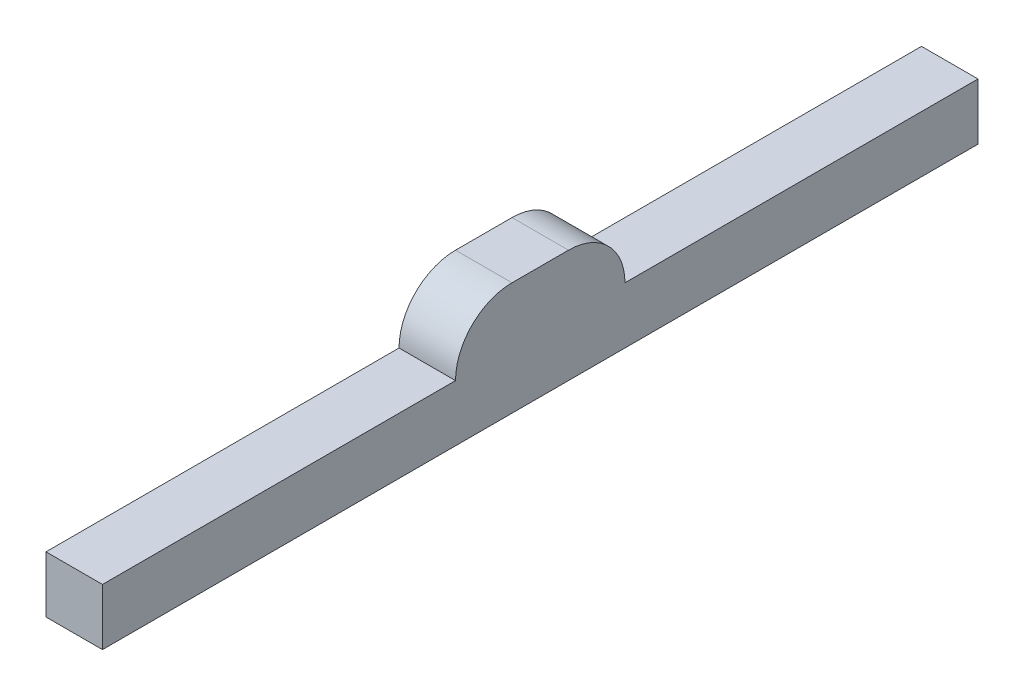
ISO-10303-21;
HEADER;
FILE_DESCRIPTION(('STEP AP214'),'2;1');
FILE_NAME('part.step','',(''),(''),'','','');
FILE_SCHEMA(('AUTOMOTIVE_DESIGN { 1 0 10303 214 1 1 1 1 }'));
ENDSEC;
DATA;
#1=APPLICATION_CONTEXT('core data for automotive mechanical design processes');
#2=APPLICATION_PROTOCOL_DEFINITION('international standard','automotive_design',2000,#1);
#3=PRODUCT_CONTEXT('',#1,'mechanical');
#4=PRODUCT('Part','Part','',(#3));
#5=PRODUCT_RELATED_PRODUCT_CATEGORY('part','',(#4));
#6=PRODUCT_DEFINITION_FORMATION('','',#4);
#7=PRODUCT_DEFINITION_CONTEXT('part definition',#1,'design');
#8=PRODUCT_DEFINITION('design','',#6,#7);
#9=PRODUCT_DEFINITION_SHAPE('','',#8);
#10=(LENGTH_UNIT() NAMED_UNIT(*) SI_UNIT(.MILLI.,.METRE.));
#11=(NAMED_UNIT(*) PLANE_ANGLE_UNIT() SI_UNIT($,.RADIAN.));
#12=(NAMED_UNIT(*) SI_UNIT($,.STERADIAN.) SOLID_ANGLE_UNIT());
#13=UNCERTAINTY_MEASURE_WITH_UNIT(LENGTH_MEASURE(1.E-05),#10,'distance_accuracy_value','');
#14=(GEOMETRIC_REPRESENTATION_CONTEXT(3) GLOBAL_UNCERTAINTY_ASSIGNED_CONTEXT((#13)) GLOBAL_UNIT_ASSIGNED_CONTEXT((#10,
#11,#12)) REPRESENTATION_CONTEXT('',''));
#15=CARTESIAN_POINT('',(0.,0.,0.));
#16=DIRECTION('',(0.,0.,1.));
#17=DIRECTION('',(1.,0.,0.));
#18=AXIS2_PLACEMENT_3D('',#15,#16,#17);
#19=CARTESIAN_POINT('',(0.,2.,31.));
#20=DIRECTION('',(0.,-1.,0.));
#21=DIRECTION('',(0.,0.,-1.));
#22=AXIS2_PLACEMENT_3D('',#19,#20,#21);
#23=PLANE('',#22);
#24=DIRECTION('',(1.,0.,0.));
#25=VECTOR('',#24,1.);
#26=CARTESIAN_POINT('',(0.,2.,18.5));
#27=LINE('',#26,#25);
#28=CARTESIAN_POINT('',(0.,2.,18.5));
#29=VERTEX_POINT('',#28);
#30=CARTESIAN_POINT('',(2.,2.,18.5));
#31=VERTEX_POINT('',#30);
#32=EDGE_CURVE('E132',#29,#31,#27,.T.);
#33=ORIENTED_EDGE('',*,*,#32,.F.);
#34=DIRECTION('',(0.,0.,-1.));
#35=VECTOR('',#34,1.);
#36=CARTESIAN_POINT('',(0.,2.,31.));
#37=LINE('',#36,#35);
#38=CARTESIAN_POINT('',(0.,2.,31.));
#39=VERTEX_POINT('',#38);
#40=EDGE_CURVE('E126',#39,#29,#37,.T.);
#41=ORIENTED_EDGE('',*,*,#40,.F.);
#42=DIRECTION('',(-1.,0.,0.));
#43=VECTOR('',#42,1.);
#44=CARTESIAN_POINT('',(0.,2.,31.));
#45=LINE('',#44,#43);
#46=CARTESIAN_POINT('',(2.,2.,31.));
#47=VERTEX_POINT('',#46);
#48=EDGE_CURVE('E127',#47,#39,#45,.T.);
#49=ORIENTED_EDGE('',*,*,#48,.F.);
#50=DIRECTION('',(0.,0.,-1.));
#51=VECTOR('',#50,1.);
#52=CARTESIAN_POINT('',(2.,2.,31.));
#53=LINE('',#52,#51);
#54=EDGE_CURVE('E167',#47,#31,#53,.T.);
#55=ORIENTED_EDGE('',*,*,#54,.T.);
#56=EDGE_LOOP('',(#33,#41,#49,#55));
#57=FACE_BOUND('',#56,.T.);
#58=ADVANCED_FACE('F45',(#57),#23,.F.);
#59=DIRECTION('',(-1.,0.,0.));
#60=VECTOR('',#59,1.);
#61=CARTESIAN_POINT('',(0.,2.,12.5));
#62=LINE('',#61,#60);
#63=CARTESIAN_POINT('',(2.,2.,12.5));
#64=VERTEX_POINT('',#63);
#65=CARTESIAN_POINT('',(0.,2.,12.5));
#66=VERTEX_POINT('',#65);
#67=EDGE_CURVE('E120',#64,#66,#62,.T.);
#68=ORIENTED_EDGE('',*,*,#67,.F.);
#69=CARTESIAN_POINT('',(2.,2.,0.));
#70=VERTEX_POINT('',#69);
#71=EDGE_CURVE('E166',#64,#70,#53,.T.);
#72=ORIENTED_EDGE('',*,*,#71,.T.);
#73=DIRECTION('',(-1.,0.,0.));
#74=VECTOR('',#73,1.);
#75=CARTESIAN_POINT('',(0.,2.,0.));
#76=LINE('',#75,#74);
#77=CARTESIAN_POINT('',(0.,2.,0.));
#78=VERTEX_POINT('',#77);
#79=EDGE_CURVE('E123',#70,#78,#76,.T.);
#80=ORIENTED_EDGE('',*,*,#79,.T.);
#81=EDGE_CURVE('E113',#66,#78,#37,.T.);
#82=ORIENTED_EDGE('',*,*,#81,.F.);
#83=EDGE_LOOP('',(#68,#72,#80,#82));
#84=FACE_BOUND('',#83,.T.);
#85=ADVANCED_FACE('F119',(#84),#23,.F.);
#86=CARTESIAN_POINT('',(0.,0.,31.));
#87=DIRECTION('',(1.,0.,0.));
#88=DIRECTION('',(0.,0.,-1.));
#89=AXIS2_PLACEMENT_3D('',#86,#87,#88);
#90=PLANE('',#89);
#91=DIRECTION('',(0.,0.,1.));
#92=VECTOR('',#91,1.);
#93=CARTESIAN_POINT('',(0.,4.,18.5));
#94=LINE('',#93,#92);
#95=CARTESIAN_POINT('',(0.,4.,14.5));
#96=VERTEX_POINT('',#95);
#97=CARTESIAN_POINT('',(0.,4.,16.5));
#98=VERTEX_POINT('',#97);
#99=EDGE_CURVE('E115',#96,#98,#94,.T.);
#100=ORIENTED_EDGE('',*,*,#99,.F.);
#101=CARTESIAN_POINT('',(0.,2.,14.5));
#102=DIRECTION('',(1.,0.,0.));
#103=DIRECTION('',(0.,0.,-1.));
#104=AXIS2_PLACEMENT_3D('',#101,#102,#103);
#105=CIRCLE('',#104,2.);
#106=EDGE_CURVE('E69',#96,#66,#105,.F.);
#107=ORIENTED_EDGE('',*,*,#106,.T.);
#108=ORIENTED_EDGE('',*,*,#81,.T.);
#109=DIRECTION('',(0.,-1.,0.));
#110=VECTOR('',#109,1.);
#111=CARTESIAN_POINT('',(0.,0.,0.));
#112=LINE('',#111,#110);
#113=CARTESIAN_POINT('',(0.,0.,0.));
#114=VERTEX_POINT('',#113);
#115=EDGE_CURVE('E153',#78,#114,#112,.T.);
#116=ORIENTED_EDGE('',*,*,#115,.T.);
#117=DIRECTION('',(0.,0.,-1.));
#118=VECTOR('',#117,1.);
#119=CARTESIAN_POINT('',(0.,0.,31.));
#120=LINE('',#119,#118);
#121=CARTESIAN_POINT('',(0.,0.,31.));
#122=VERTEX_POINT('',#121);
#123=EDGE_CURVE('E175',#122,#114,#120,.T.);
#124=ORIENTED_EDGE('',*,*,#123,.F.);
#125=DIRECTION('',(0.,-1.,0.));
#126=VECTOR('',#125,1.);
#127=CARTESIAN_POINT('',(0.,0.,31.));
#128=LINE('',#127,#126);
#129=EDGE_CURVE('E141',#39,#122,#128,.T.);
#130=ORIENTED_EDGE('',*,*,#129,.F.);
#131=ORIENTED_EDGE('',*,*,#40,.T.);
#132=CARTESIAN_POINT('',(0.,2.,16.5));
#133=DIRECTION('',(1.,0.,0.));
#134=DIRECTION('',(0.,0.,-1.));
#135=AXIS2_PLACEMENT_3D('',#132,#133,#134);
#136=CIRCLE('',#135,2.);
#137=EDGE_CURVE('E61',#29,#98,#136,.F.);
#138=ORIENTED_EDGE('',*,*,#137,.T.);
#139=EDGE_LOOP('',(#100,#107,#108,#116,#124,#130,#131,#138));
#140=FACE_BOUND('',#139,.T.);
#141=ADVANCED_FACE('F111',(#140),#90,.F.);
#142=CARTESIAN_POINT('',(0.,0.,31.));
#143=DIRECTION('',(0.,1.,0.));
#144=DIRECTION('',(0.,0.,1.));
#145=AXIS2_PLACEMENT_3D('',#142,#143,#144);
#146=PLANE('',#145);
#147=DIRECTION('',(1.,0.,0.));
#148=VECTOR('',#147,1.);
#149=CARTESIAN_POINT('',(0.,0.,0.));
#150=LINE('',#149,#148);
#151=CARTESIAN_POINT('',(2.,0.,0.));
#152=VERTEX_POINT('',#151);
#153=EDGE_CURVE('E156',#114,#152,#150,.T.);
#154=ORIENTED_EDGE('',*,*,#153,.T.);
#155=DIRECTION('',(0.,0.,-1.));
#156=VECTOR('',#155,1.);
#157=CARTESIAN_POINT('',(2.,0.,31.));
#158=LINE('',#157,#156);
#159=CARTESIAN_POINT('',(2.,0.,31.));
#160=VERTEX_POINT('',#159);
#161=EDGE_CURVE('E171',#160,#152,#158,.T.);
#162=ORIENTED_EDGE('',*,*,#161,.F.);
#163=DIRECTION('',(1.,0.,0.));
#164=VECTOR('',#163,1.);
#165=CARTESIAN_POINT('',(0.,0.,31.));
#166=LINE('',#165,#164);
#167=EDGE_CURVE('E145',#122,#160,#166,.T.);
#168=ORIENTED_EDGE('',*,*,#167,.F.);
#169=ORIENTED_EDGE('',*,*,#123,.T.);
#170=EDGE_LOOP('',(#154,#162,#168,#169));
#171=FACE_BOUND('',#170,.T.);
#172=ADVANCED_FACE('F211',(#171),#146,.F.);
#173=CARTESIAN_POINT('',(2.,0.,31.));
#174=DIRECTION('',(-1.,0.,0.));
#175=DIRECTION('',(0.,0.,1.));
#176=AXIS2_PLACEMENT_3D('',#173,#174,#175);
#177=PLANE('',#176);
#178=ORIENTED_EDGE('',*,*,#71,.F.);
#179=CARTESIAN_POINT('',(2.,2.,14.5));
#180=DIRECTION('',(-1.,0.,0.));
#181=DIRECTION('',(0.,0.,1.));
#182=AXIS2_PLACEMENT_3D('',#179,#180,#181);
#183=CIRCLE('',#182,2.);
#184=CARTESIAN_POINT('',(2.,4.,14.5));
#185=VERTEX_POINT('',#184);
#186=EDGE_CURVE('E11',#64,#185,#183,.F.);
#187=ORIENTED_EDGE('',*,*,#186,.T.);
#188=DIRECTION('',(0.,0.,-1.));
#189=VECTOR('',#188,1.);
#190=CARTESIAN_POINT('',(2.,4.,18.5));
#191=LINE('',#190,#189);
#192=CARTESIAN_POINT('',(2.,4.,16.5));
#193=VERTEX_POINT('',#192);
#194=EDGE_CURVE('E136',#193,#185,#191,.T.);
#195=ORIENTED_EDGE('',*,*,#194,.F.);
#196=CARTESIAN_POINT('',(2.,2.,16.5));
#197=DIRECTION('',(-1.,0.,0.));
#198=DIRECTION('',(0.,0.,1.));
#199=AXIS2_PLACEMENT_3D('',#196,#197,#198);
#200=CIRCLE('',#199,2.);
#201=EDGE_CURVE('E54',#193,#31,#200,.F.);
#202=ORIENTED_EDGE('',*,*,#201,.T.);
#203=ORIENTED_EDGE('',*,*,#54,.F.);
#204=DIRECTION('',(0.,1.,0.));
#205=VECTOR('',#204,1.);
#206=CARTESIAN_POINT('',(2.,0.,31.));
#207=LINE('',#206,#205);
#208=EDGE_CURVE('E148',#160,#47,#207,.T.);
#209=ORIENTED_EDGE('',*,*,#208,.F.);
#210=ORIENTED_EDGE('',*,*,#161,.T.);
#211=DIRECTION('',(0.,1.,0.));
#212=VECTOR('',#211,1.);
#213=CARTESIAN_POINT('',(2.,0.,0.));
#214=LINE('',#213,#212);
#215=EDGE_CURVE('E159',#152,#70,#214,.T.);
#216=ORIENTED_EDGE('',*,*,#215,.T.);
#217=EDGE_LOOP('',(#178,#187,#195,#202,#203,#209,#210,#216));
#218=FACE_BOUND('',#217,.T.);
#219=ADVANCED_FACE('F191',(#218),#177,.F.);
#220=CARTESIAN_POINT('',(0.,0.,31.));
#221=DIRECTION('',(0.,0.,-1.));
#222=DIRECTION('',(-1.,0.,0.));
#223=AXIS2_PLACEMENT_3D('',#220,#221,#222);
#224=PLANE('',#223);
#225=ORIENTED_EDGE('',*,*,#129,.T.);
#226=ORIENTED_EDGE('',*,*,#167,.T.);
#227=ORIENTED_EDGE('',*,*,#208,.T.);
#228=ORIENTED_EDGE('',*,*,#48,.T.);
#229=EDGE_LOOP('',(#225,#226,#227,#228));
#230=FACE_BOUND('',#229,.T.);
#231=ADVANCED_FACE('F213',(#230),#224,.F.);
#232=CARTESIAN_POINT('',(0.,0.,0.));
#233=DIRECTION('',(0.,0.,-1.));
#234=DIRECTION('',(-1.,0.,0.));
#235=AXIS2_PLACEMENT_3D('',#232,#233,#234);
#236=PLANE('',#235);
#237=ORIENTED_EDGE('',*,*,#115,.F.);
#238=ORIENTED_EDGE('',*,*,#79,.F.);
#239=ORIENTED_EDGE('',*,*,#215,.F.);
#240=ORIENTED_EDGE('',*,*,#153,.F.);
#241=EDGE_LOOP('',(#237,#238,#239,#240));
#242=FACE_BOUND('',#241,.T.);
#243=ADVANCED_FACE('F207',(#242),#236,.T.);
#244=CARTESIAN_POINT('',(0.,4.,0.));
#245=DIRECTION('',(0.,-1.,0.));
#246=DIRECTION('',(0.,0.,-1.));
#247=AXIS2_PLACEMENT_3D('',#244,#245,#246);
#248=PLANE('',#247);
#249=ORIENTED_EDGE('',*,*,#194,.T.);
#250=DIRECTION('',(-1.,0.,0.));
#251=VECTOR('',#250,1.);
#252=CARTESIAN_POINT('',(0.,4.,14.5));
#253=LINE('',#252,#251);
#254=EDGE_CURVE('E183',#185,#96,#253,.T.);
#255=ORIENTED_EDGE('',*,*,#254,.T.);
#256=ORIENTED_EDGE('',*,*,#99,.T.);
#257=DIRECTION('',(1.,0.,0.));
#258=VECTOR('',#257,1.);
#259=CARTESIAN_POINT('',(0.,4.,16.5));
#260=LINE('',#259,#258);
#261=EDGE_CURVE('E179',#98,#193,#260,.T.);
#262=ORIENTED_EDGE('',*,*,#261,.T.);
#263=EDGE_LOOP('',(#249,#255,#256,#262));
#264=FACE_BOUND('',#263,.T.);
#265=ADVANCED_FACE('F200',(#264),#248,.F.);
#266=CARTESIAN_POINT('',(0.,2.,14.5));
#267=DIRECTION('',(-1.,0.,0.));
#268=DIRECTION('',(0.,0.,1.));
#269=AXIS2_PLACEMENT_3D('',#266,#267,#268);
#270=CYLINDRICAL_SURFACE('',#269,2.);
#271=ORIENTED_EDGE('',*,*,#186,.F.);
#272=ORIENTED_EDGE('',*,*,#67,.T.);
#273=ORIENTED_EDGE('',*,*,#106,.F.);
#274=ORIENTED_EDGE('',*,*,#254,.F.);
#275=EDGE_LOOP('',(#271,#272,#273,#274));
#276=FACE_BOUND('',#275,.T.);
#277=ADVANCED_FACE('F130',(#276),#270,.T.);
#278=CARTESIAN_POINT('',(0.,2.,16.5));
#279=DIRECTION('',(1.,0.,0.));
#280=DIRECTION('',(0.,0.,-1.));
#281=AXIS2_PLACEMENT_3D('',#278,#279,#280);
#282=CYLINDRICAL_SURFACE('',#281,2.);
#283=ORIENTED_EDGE('',*,*,#137,.F.);
#284=ORIENTED_EDGE('',*,*,#32,.T.);
#285=ORIENTED_EDGE('',*,*,#201,.F.);
#286=ORIENTED_EDGE('',*,*,#261,.F.);
#287=EDGE_LOOP('',(#283,#284,#285,#286));
#288=FACE_BOUND('',#287,.T.);
#289=ADVANCED_FACE('F47',(#288),#282,.T.);
#290=CLOSED_SHELL('',(#58,#85,#141,#172,#219,#231,#243,#265,#277,#289));
#291=MANIFOLD_SOLID_BREP('B2',#290);
#292=ADVANCED_BREP_SHAPE_REPRESENTATION('',(#18,#291),#14);
#293=SHAPE_DEFINITION_REPRESENTATION(#9,#292);
ENDSEC;
END-ISO-10303-21;
